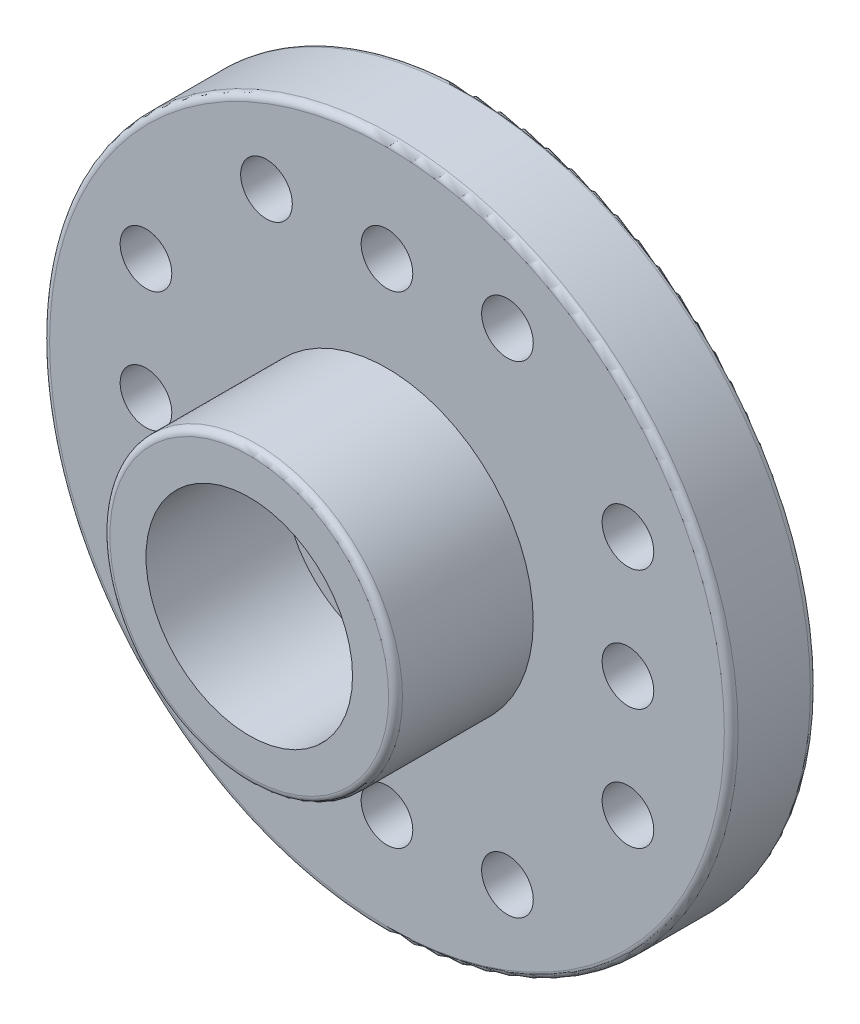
ISO-10303-21;
HEADER;
FILE_DESCRIPTION(('STEP AP214'),'2;1');
FILE_NAME('part.step','',(''),(''),'','','');
FILE_SCHEMA(('AUTOMOTIVE_DESIGN { 1 0 10303 214 1 1 1 1 }'));
ENDSEC;
DATA;
#1=APPLICATION_CONTEXT('core data for automotive mechanical design processes');
#2=APPLICATION_PROTOCOL_DEFINITION('international standard','automotive_design',2000,#1);
#3=PRODUCT_CONTEXT('',#1,'mechanical');
#4=PRODUCT('Part','Part','',(#3));
#5=PRODUCT_RELATED_PRODUCT_CATEGORY('part','',(#4));
#6=PRODUCT_DEFINITION_FORMATION('','',#4);
#7=PRODUCT_DEFINITION_CONTEXT('part definition',#1,'design');
#8=PRODUCT_DEFINITION('design','',#6,#7);
#9=PRODUCT_DEFINITION_SHAPE('','',#8);
#10=(LENGTH_UNIT() NAMED_UNIT(*) SI_UNIT(.MILLI.,.METRE.));
#11=(NAMED_UNIT(*) PLANE_ANGLE_UNIT() SI_UNIT($,.RADIAN.));
#12=(NAMED_UNIT(*) SI_UNIT($,.STERADIAN.) SOLID_ANGLE_UNIT());
#13=UNCERTAINTY_MEASURE_WITH_UNIT(LENGTH_MEASURE(1.E-05),#10,'distance_accuracy_value','');
#14=(GEOMETRIC_REPRESENTATION_CONTEXT(3) GLOBAL_UNCERTAINTY_ASSIGNED_CONTEXT((#13)) GLOBAL_UNIT_ASSIGNED_CONTEXT((#10,
#11,#12)) REPRESENTATION_CONTEXT('',''));
#15=CARTESIAN_POINT('',(0.,0.,0.));
#16=DIRECTION('',(0.,0.,1.));
#17=DIRECTION('',(1.,0.,0.));
#18=AXIS2_PLACEMENT_3D('',#15,#16,#17);
#19=CARTESIAN_POINT('',(0.,0.,0.8));
#20=DIRECTION('',(0.,0.,-1.));
#21=DIRECTION('',(-1.,0.,0.));
#22=AXIS2_PLACEMENT_3D('',#19,#20,#21);
#23=PLANE('',#22);
#24=CARTESIAN_POINT('',(0.,0.,0.8));
#25=DIRECTION('',(0.,0.,-1.));
#26=DIRECTION('',(-1.,0.,0.));
#27=AXIS2_PLACEMENT_3D('',#24,#25,#26);
#28=CIRCLE('',#27,4.5);
#29=CARTESIAN_POINT('',(-4.5,0.,0.8));
#30=VERTEX_POINT('',#29);
#31=EDGE_CURVE('E71',#30,#30,#28,.T.);
#32=ORIENTED_EDGE('',*,*,#31,.T.);
#33=EDGE_LOOP('',(#32));
#34=FACE_BOUND('',#33,.T.);
#35=CARTESIAN_POINT('',(-0.162730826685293,0.,0.8));
#36=DIRECTION('',(0.,0.,-1.));
#37=DIRECTION('',(-1.,0.,0.));
#38=AXIS2_PLACEMENT_3D('',#35,#36,#37);
#39=CIRCLE('',#38,3.7);
#40=CARTESIAN_POINT('',(-3.86273082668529,0.,0.8));
#41=VERTEX_POINT('',#40);
#42=EDGE_CURVE('E157',#41,#41,#39,.T.);
#43=ORIENTED_EDGE('',*,*,#42,.F.);
#44=EDGE_LOOP('',(#43));
#45=FACE_BOUND('',#44,.T.);
#46=ADVANCED_FACE('F31',(#34,#45),#23,.T.);
#47=CARTESIAN_POINT('',(0.,0.,2.5));
#48=DIRECTION('',(0.,0.,-1.));
#49=DIRECTION('',(-1.,0.,0.));
#50=AXIS2_PLACEMENT_3D('',#47,#48,#49);
#51=CYLINDRICAL_SURFACE('',#50,1.5);
#52=CARTESIAN_POINT('',(0.,0.,2.5));
#53=DIRECTION('',(0.,0.,1.));
#54=DIRECTION('',(1.,0.,0.));
#55=AXIS2_PLACEMENT_3D('',#52,#53,#54);
#56=CIRCLE('',#55,1.5);
#57=CARTESIAN_POINT('',(1.5,0.,2.5));
#58=VERTEX_POINT('',#57);
#59=EDGE_CURVE('E144',#58,#58,#56,.T.);
#60=ORIENTED_EDGE('',*,*,#59,.T.);
#61=EDGE_LOOP('',(#60));
#62=FACE_BOUND('',#61,.T.);
#63=CARTESIAN_POINT('',(0.,0.,0.8));
#64=DIRECTION('',(0.,0.,-1.));
#65=DIRECTION('',(-1.,0.,0.));
#66=AXIS2_PLACEMENT_3D('',#63,#64,#65);
#67=CIRCLE('',#66,1.5);
#68=CARTESIAN_POINT('',(-1.5,0.,0.8));
#69=VERTEX_POINT('',#68);
#70=EDGE_CURVE('E67',#69,#69,#67,.T.);
#71=ORIENTED_EDGE('',*,*,#70,.T.);
#72=EDGE_LOOP('',(#71));
#73=FACE_BOUND('',#72,.T.);
#74=ADVANCED_FACE('F186',(#62,#73),#51,.F.);
#75=CARTESIAN_POINT('',(0.,0.,2.5));
#76=DIRECTION('',(0.,0.,1.));
#77=DIRECTION('',(1.,0.,0.));
#78=AXIS2_PLACEMENT_3D('',#75,#76,#77);
#79=PLANE('',#78);
#80=CARTESIAN_POINT('',(0.,0.,2.5));
#81=DIRECTION('',(0.,0.,1.));
#82=DIRECTION('',(1.,0.,0.));
#83=AXIS2_PLACEMENT_3D('',#80,#81,#82);
#84=CIRCLE('',#83,9.79999999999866);
#85=CARTESIAN_POINT('',(9.79999999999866,0.,2.5));
#86=VERTEX_POINT('',#85);
#87=EDGE_CURVE('E10',#86,#86,#84,.T.);
#88=ORIENTED_EDGE('',*,*,#87,.T.);
#89=EDGE_LOOP('',(#88));
#90=FACE_BOUND('',#89,.T.);
#91=CARTESIAN_POINT('',(-7.,3.5,2.5));
#92=DIRECTION('',(0.,0.,1.));
#93=DIRECTION('',(1.,0.,0.));
#94=AXIS2_PLACEMENT_3D('',#91,#92,#93);
#95=CIRCLE('',#94,0.749999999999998);
#96=CARTESIAN_POINT('',(-6.25,3.5,2.5));
#97=VERTEX_POINT('',#96);
#98=EDGE_CURVE('E138',#97,#97,#95,.T.);
#99=ORIENTED_EDGE('',*,*,#98,.F.);
#100=EDGE_LOOP('',(#99));
#101=FACE_BOUND('',#100,.T.);
#102=CARTESIAN_POINT('',(-3.49999999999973,-6.99999999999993,2.5));
#103=DIRECTION('',(0.,0.,1.));
#104=DIRECTION('',(1.,0.,0.));
#105=AXIS2_PLACEMENT_3D('',#102,#103,#104);
#106=CIRCLE('',#105,0.749999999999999);
#107=CARTESIAN_POINT('',(-2.74999999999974,-6.99999999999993,2.5));
#108=VERTEX_POINT('',#107);
#109=EDGE_CURVE('E126',#108,#108,#106,.T.);
#110=ORIENTED_EDGE('',*,*,#109,.F.);
#111=EDGE_LOOP('',(#110));
#112=FACE_BOUND('',#111,.T.);
#113=CARTESIAN_POINT('',(2.65831209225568E-13,-6.99999999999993,2.5));
#114=DIRECTION('',(0.,0.,1.));
#115=DIRECTION('',(1.,0.,0.));
#116=AXIS2_PLACEMENT_3D('',#113,#114,#115);
#117=CIRCLE('',#116,0.749999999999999);
#118=CARTESIAN_POINT('',(0.750000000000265,-6.99999999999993,2.5));
#119=VERTEX_POINT('',#118);
#120=EDGE_CURVE('E114',#119,#119,#117,.T.);
#121=ORIENTED_EDGE('',*,*,#120,.F.);
#122=EDGE_LOOP('',(#121));
#123=FACE_BOUND('',#122,.T.);
#124=CARTESIAN_POINT('',(7.0000000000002,3.50000000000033,2.5));
#125=DIRECTION('',(0.,0.,1.));
#126=DIRECTION('',(1.,0.,0.));
#127=AXIS2_PLACEMENT_3D('',#124,#125,#126);
#128=CIRCLE('',#127,0.749999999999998);
#129=CARTESIAN_POINT('',(7.7500000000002,3.50000000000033,2.5));
#130=VERTEX_POINT('',#129);
#131=EDGE_CURVE('E102',#130,#130,#128,.T.);
#132=ORIENTED_EDGE('',*,*,#131,.F.);
#133=EDGE_LOOP('',(#132));
#134=FACE_BOUND('',#133,.T.);
#135=CARTESIAN_POINT('',(3.49999999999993,7.00000000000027,2.5));
#136=DIRECTION('',(0.,0.,1.));
#137=DIRECTION('',(1.,0.,0.));
#138=AXIS2_PLACEMENT_3D('',#135,#136,#137);
#139=CIRCLE('',#138,0.749999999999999);
#140=CARTESIAN_POINT('',(4.24999999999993,7.00000000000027,2.5));
#141=VERTEX_POINT('',#140);
#142=EDGE_CURVE('E90',#141,#141,#139,.T.);
#143=ORIENTED_EDGE('',*,*,#142,.F.);
#144=EDGE_LOOP('',(#143));
#145=FACE_BOUND('',#144,.T.);
#146=CARTESIAN_POINT('',(0.,7.00000000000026,2.5));
#147=DIRECTION('',(0.,0.,1.));
#148=DIRECTION('',(1.,0.,0.));
#149=AXIS2_PLACEMENT_3D('',#146,#147,#148);
#150=CIRCLE('',#149,0.749999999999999);
#151=CARTESIAN_POINT('',(0.74999999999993,7.00000000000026,2.5));
#152=VERTEX_POINT('',#151);
#153=EDGE_CURVE('E78',#152,#152,#150,.T.);
#154=ORIENTED_EDGE('',*,*,#153,.F.);
#155=EDGE_LOOP('',(#154));
#156=FACE_BOUND('',#155,.T.);
#157=CARTESIAN_POINT('',(-7.,0.,2.5));
#158=DIRECTION('',(0.,0.,1.));
#159=DIRECTION('',(1.,0.,0.));
#160=AXIS2_PLACEMENT_3D('',#157,#158,#159);
#161=CIRCLE('',#160,0.749999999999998);
#162=CARTESIAN_POINT('',(-6.25,0.,2.5));
#163=VERTEX_POINT('',#162);
#164=EDGE_CURVE('E74',#163,#163,#161,.T.);
#165=ORIENTED_EDGE('',*,*,#164,.F.);
#166=EDGE_LOOP('',(#165));
#167=FACE_BOUND('',#166,.T.);
#168=CARTESIAN_POINT('',(-3.50000000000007,7.00000000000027,2.5));
#169=DIRECTION('',(0.,0.,1.));
#170=DIRECTION('',(1.,0.,0.));
#171=AXIS2_PLACEMENT_3D('',#168,#169,#170);
#172=CIRCLE('',#171,0.749999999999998);
#173=CARTESIAN_POINT('',(-2.75000000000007,7.00000000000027,2.5));
#174=VERTEX_POINT('',#173);
#175=EDGE_CURVE('E84',#174,#174,#172,.T.);
#176=ORIENTED_EDGE('',*,*,#175,.F.);
#177=EDGE_LOOP('',(#176));
#178=FACE_BOUND('',#177,.T.);
#179=CARTESIAN_POINT('',(7.0000000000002,3.3392416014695E-13,2.5));
#180=DIRECTION('',(0.,0.,1.));
#181=DIRECTION('',(1.,0.,0.));
#182=AXIS2_PLACEMENT_3D('',#179,#180,#181);
#183=CIRCLE('',#182,0.749999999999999);
#184=CARTESIAN_POINT('',(7.7500000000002,3.3392416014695E-13,2.5));
#185=VERTEX_POINT('',#184);
#186=EDGE_CURVE('E96',#185,#185,#183,.T.);
#187=ORIENTED_EDGE('',*,*,#186,.F.);
#188=EDGE_LOOP('',(#187));
#189=FACE_BOUND('',#188,.T.);
#190=CARTESIAN_POINT('',(7.0000000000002,-3.49999999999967,2.5));
#191=DIRECTION('',(0.,0.,1.));
#192=DIRECTION('',(1.,0.,0.));
#193=AXIS2_PLACEMENT_3D('',#190,#191,#192);
#194=CIRCLE('',#193,0.749999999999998);
#195=CARTESIAN_POINT('',(7.7500000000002,-3.49999999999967,2.5));
#196=VERTEX_POINT('',#195);
#197=EDGE_CURVE('E108',#196,#196,#194,.T.);
#198=ORIENTED_EDGE('',*,*,#197,.F.);
#199=EDGE_LOOP('',(#198));
#200=FACE_BOUND('',#199,.T.);
#201=CARTESIAN_POINT('',(3.50000000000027,-6.99999999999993,2.5));
#202=DIRECTION('',(0.,0.,1.));
#203=DIRECTION('',(1.,0.,0.));
#204=AXIS2_PLACEMENT_3D('',#201,#202,#203);
#205=CIRCLE('',#204,0.749999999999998);
#206=CARTESIAN_POINT('',(4.25000000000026,-6.99999999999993,2.5));
#207=VERTEX_POINT('',#206);
#208=EDGE_CURVE('E120',#207,#207,#205,.T.);
#209=ORIENTED_EDGE('',*,*,#208,.F.);
#210=EDGE_LOOP('',(#209));
#211=FACE_BOUND('',#210,.T.);
#212=CARTESIAN_POINT('',(-7.,-3.5,2.5));
#213=DIRECTION('',(0.,0.,1.));
#214=DIRECTION('',(1.,0.,0.));
#215=AXIS2_PLACEMENT_3D('',#212,#213,#214);
#216=CIRCLE('',#215,0.749999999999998);
#217=CARTESIAN_POINT('',(-6.25,-3.5,2.5));
#218=VERTEX_POINT('',#217);
#219=EDGE_CURVE('E132',#218,#218,#216,.T.);
#220=ORIENTED_EDGE('',*,*,#219,.F.);
#221=EDGE_LOOP('',(#220));
#222=FACE_BOUND('',#221,.T.);
#223=CARTESIAN_POINT('',(0.,0.,2.5));
#224=DIRECTION('',(0.,0.,1.));
#225=DIRECTION('',(1.,0.,0.));
#226=AXIS2_PLACEMENT_3D('',#223,#224,#225);
#227=CIRCLE('',#226,4.25);
#228=CARTESIAN_POINT('',(4.25,0.,2.5));
#229=VERTEX_POINT('',#228);
#230=EDGE_CURVE('E149',#229,#229,#227,.T.);
#231=ORIENTED_EDGE('',*,*,#230,.F.);
#232=EDGE_LOOP('',(#231));
#233=FACE_BOUND('',#232,.T.);
#234=ADVANCED_FACE('F191',(#90,#101,#112,#123,#134,#145,#156,#167,#178,#189,#200,#211,#222,
#233),#79,.T.);
#235=CARTESIAN_POINT('',(0.,0.,2.5));
#236=DIRECTION('',(0.,0.,1.));
#237=DIRECTION('',(1.,0.,0.));
#238=AXIS2_PLACEMENT_3D('',#235,#236,#237);
#239=CIRCLE('',#238,3.);
#240=CARTESIAN_POINT('',(3.,0.,2.5));
#241=VERTEX_POINT('',#240);
#242=EDGE_CURVE('E66',#241,#241,#239,.F.);
#243=ORIENTED_EDGE('',*,*,#242,.F.);
#244=EDGE_LOOP('',(#243));
#245=FACE_BOUND('',#244,.T.);
#246=ORIENTED_EDGE('',*,*,#59,.F.);
#247=EDGE_LOOP('',(#246));
#248=FACE_BOUND('',#247,.T.);
#249=ADVANCED_FACE('F260',(#245,#248),#79,.T.);
#250=CARTESIAN_POINT('',(0.,0.,0.));
#251=DIRECTION('',(0.,0.,1.));
#252=DIRECTION('',(1.,0.,0.));
#253=AXIS2_PLACEMENT_3D('',#250,#251,#252);
#254=PLANE('',#253);
#255=CARTESIAN_POINT('',(0.,0.,0.));
#256=DIRECTION('',(0.,0.,1.));
#257=DIRECTION('',(1.,0.,0.));
#258=AXIS2_PLACEMENT_3D('',#255,#256,#257);
#259=CIRCLE('',#258,4.7);
#260=CARTESIAN_POINT('',(4.7,0.,0.));
#261=VERTEX_POINT('',#260);
#262=EDGE_CURVE('E54',#261,#261,#259,.T.);
#263=ORIENTED_EDGE('',*,*,#262,.T.);
#264=EDGE_LOOP('',(#263));
#265=FACE_BOUND('',#264,.T.);
#266=CARTESIAN_POINT('',(0.,0.,0.));
#267=DIRECTION('',(0.,0.,1.));
#268=DIRECTION('',(1.,0.,0.));
#269=AXIS2_PLACEMENT_3D('',#266,#267,#268);
#270=CIRCLE('',#269,9.79999999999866);
#271=CARTESIAN_POINT('',(9.79999999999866,0.,0.));
#272=VERTEX_POINT('',#271);
#273=EDGE_CURVE('E57',#272,#272,#270,.F.);
#274=ORIENTED_EDGE('',*,*,#273,.T.);
#275=EDGE_LOOP('',(#274));
#276=FACE_BOUND('',#275,.T.);
#277=CARTESIAN_POINT('',(-7.,3.5,0.));
#278=DIRECTION('',(0.,0.,1.));
#279=DIRECTION('',(1.,0.,0.));
#280=AXIS2_PLACEMENT_3D('',#277,#278,#279);
#281=CIRCLE('',#280,0.749999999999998);
#282=CARTESIAN_POINT('',(-6.25,3.5,0.));
#283=VERTEX_POINT('',#282);
#284=EDGE_CURVE('E141',#283,#283,#281,.T.);
#285=ORIENTED_EDGE('',*,*,#284,.T.);
#286=EDGE_LOOP('',(#285));
#287=FACE_BOUND('',#286,.T.);
#288=CARTESIAN_POINT('',(-3.49999999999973,-6.99999999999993,0.));
#289=DIRECTION('',(0.,0.,1.));
#290=DIRECTION('',(1.,0.,0.));
#291=AXIS2_PLACEMENT_3D('',#288,#289,#290);
#292=CIRCLE('',#291,0.749999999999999);
#293=CARTESIAN_POINT('',(-2.74999999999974,-6.99999999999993,0.));
#294=VERTEX_POINT('',#293);
#295=EDGE_CURVE('E129',#294,#294,#292,.T.);
#296=ORIENTED_EDGE('',*,*,#295,.T.);
#297=EDGE_LOOP('',(#296));
#298=FACE_BOUND('',#297,.T.);
#299=CARTESIAN_POINT('',(2.65831209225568E-13,-6.99999999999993,0.));
#300=DIRECTION('',(0.,0.,1.));
#301=DIRECTION('',(1.,0.,0.));
#302=AXIS2_PLACEMENT_3D('',#299,#300,#301);
#303=CIRCLE('',#302,0.749999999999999);
#304=CARTESIAN_POINT('',(0.750000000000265,-6.99999999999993,0.));
#305=VERTEX_POINT('',#304);
#306=EDGE_CURVE('E117',#305,#305,#303,.T.);
#307=ORIENTED_EDGE('',*,*,#306,.T.);
#308=EDGE_LOOP('',(#307));
#309=FACE_BOUND('',#308,.T.);
#310=CARTESIAN_POINT('',(7.0000000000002,3.50000000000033,0.));
#311=DIRECTION('',(0.,0.,1.));
#312=DIRECTION('',(1.,0.,0.));
#313=AXIS2_PLACEMENT_3D('',#310,#311,#312);
#314=CIRCLE('',#313,0.749999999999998);
#315=CARTESIAN_POINT('',(7.7500000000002,3.50000000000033,0.));
#316=VERTEX_POINT('',#315);
#317=EDGE_CURVE('E105',#316,#316,#314,.T.);
#318=ORIENTED_EDGE('',*,*,#317,.T.);
#319=EDGE_LOOP('',(#318));
#320=FACE_BOUND('',#319,.T.);
#321=CARTESIAN_POINT('',(3.49999999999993,7.00000000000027,0.));
#322=DIRECTION('',(0.,0.,1.));
#323=DIRECTION('',(1.,0.,0.));
#324=AXIS2_PLACEMENT_3D('',#321,#322,#323);
#325=CIRCLE('',#324,0.749999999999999);
#326=CARTESIAN_POINT('',(4.24999999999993,7.00000000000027,0.));
#327=VERTEX_POINT('',#326);
#328=EDGE_CURVE('E93',#327,#327,#325,.T.);
#329=ORIENTED_EDGE('',*,*,#328,.T.);
#330=EDGE_LOOP('',(#329));
#331=FACE_BOUND('',#330,.T.);
#332=CARTESIAN_POINT('',(0.,7.00000000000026,0.));
#333=DIRECTION('',(0.,0.,1.));
#334=DIRECTION('',(1.,0.,0.));
#335=AXIS2_PLACEMENT_3D('',#332,#333,#334);
#336=CIRCLE('',#335,0.749999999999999);
#337=CARTESIAN_POINT('',(0.74999999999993,7.00000000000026,0.));
#338=VERTEX_POINT('',#337);
#339=EDGE_CURVE('E81',#338,#338,#336,.T.);
#340=ORIENTED_EDGE('',*,*,#339,.T.);
#341=EDGE_LOOP('',(#340));
#342=FACE_BOUND('',#341,.T.);
#343=CARTESIAN_POINT('',(-7.,0.,0.));
#344=DIRECTION('',(0.,0.,1.));
#345=DIRECTION('',(1.,0.,0.));
#346=AXIS2_PLACEMENT_3D('',#343,#344,#345);
#347=CIRCLE('',#346,0.749999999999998);
#348=CARTESIAN_POINT('',(-6.25,0.,0.));
#349=VERTEX_POINT('',#348);
#350=EDGE_CURVE('E75',#349,#349,#347,.T.);
#351=ORIENTED_EDGE('',*,*,#350,.T.);
#352=EDGE_LOOP('',(#351));
#353=FACE_BOUND('',#352,.T.);
#354=CARTESIAN_POINT('',(-3.50000000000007,7.00000000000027,0.));
#355=DIRECTION('',(0.,0.,1.));
#356=DIRECTION('',(1.,0.,0.));
#357=AXIS2_PLACEMENT_3D('',#354,#355,#356);
#358=CIRCLE('',#357,0.749999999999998);
#359=CARTESIAN_POINT('',(-2.75000000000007,7.00000000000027,0.));
#360=VERTEX_POINT('',#359);
#361=EDGE_CURVE('E87',#360,#360,#358,.T.);
#362=ORIENTED_EDGE('',*,*,#361,.T.);
#363=EDGE_LOOP('',(#362));
#364=FACE_BOUND('',#363,.T.);
#365=CARTESIAN_POINT('',(7.0000000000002,3.3392416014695E-13,0.));
#366=DIRECTION('',(0.,0.,1.));
#367=DIRECTION('',(1.,0.,0.));
#368=AXIS2_PLACEMENT_3D('',#365,#366,#367);
#369=CIRCLE('',#368,0.749999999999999);
#370=CARTESIAN_POINT('',(7.7500000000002,3.3392416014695E-13,0.));
#371=VERTEX_POINT('',#370);
#372=EDGE_CURVE('E99',#371,#371,#369,.T.);
#373=ORIENTED_EDGE('',*,*,#372,.T.);
#374=EDGE_LOOP('',(#373));
#375=FACE_BOUND('',#374,.T.);
#376=CARTESIAN_POINT('',(7.0000000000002,-3.49999999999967,0.));
#377=DIRECTION('',(0.,0.,1.));
#378=DIRECTION('',(1.,0.,0.));
#379=AXIS2_PLACEMENT_3D('',#376,#377,#378);
#380=CIRCLE('',#379,0.749999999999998);
#381=CARTESIAN_POINT('',(7.7500000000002,-3.49999999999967,0.));
#382=VERTEX_POINT('',#381);
#383=EDGE_CURVE('E111',#382,#382,#380,.T.);
#384=ORIENTED_EDGE('',*,*,#383,.T.);
#385=EDGE_LOOP('',(#384));
#386=FACE_BOUND('',#385,.T.);
#387=CARTESIAN_POINT('',(3.50000000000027,-6.99999999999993,0.));
#388=DIRECTION('',(0.,0.,1.));
#389=DIRECTION('',(1.,0.,0.));
#390=AXIS2_PLACEMENT_3D('',#387,#388,#389);
#391=CIRCLE('',#390,0.749999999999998);
#392=CARTESIAN_POINT('',(4.25000000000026,-6.99999999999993,0.));
#393=VERTEX_POINT('',#392);
#394=EDGE_CURVE('E123',#393,#393,#391,.T.);
#395=ORIENTED_EDGE('',*,*,#394,.T.);
#396=EDGE_LOOP('',(#395));
#397=FACE_BOUND('',#396,.T.);
#398=CARTESIAN_POINT('',(-7.,-3.5,0.));
#399=DIRECTION('',(0.,0.,1.));
#400=DIRECTION('',(1.,0.,0.));
#401=AXIS2_PLACEMENT_3D('',#398,#399,#400);
#402=CIRCLE('',#401,0.749999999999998);
#403=CARTESIAN_POINT('',(-6.25,-3.5,0.));
#404=VERTEX_POINT('',#403);
#405=EDGE_CURVE('E135',#404,#404,#402,.T.);
#406=ORIENTED_EDGE('',*,*,#405,.T.);
#407=EDGE_LOOP('',(#406));
#408=FACE_BOUND('',#407,.T.);
#409=ADVANCED_FACE('F263',(#265,#276,#287,#298,#309,#320,#331,#342,#353,#364,#375,#386,#397,
#408),#254,.F.);
#410=CARTESIAN_POINT('',(0.,0.,2.5));
#411=DIRECTION('',(0.,0.,-1.));
#412=DIRECTION('',(-1.,0.,0.));
#413=AXIS2_PLACEMENT_3D('',#410,#411,#412);
#414=CYLINDRICAL_SURFACE('',#413,9.99999999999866);
#415=CARTESIAN_POINT('',(0.,0.,0.2));
#416=DIRECTION('',(0.,0.,1.));
#417=DIRECTION('',(1.,0.,0.));
#418=AXIS2_PLACEMENT_3D('',#415,#416,#417);
#419=CIRCLE('',#418,9.99999999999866);
#420=CARTESIAN_POINT('',(9.99999999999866,0.,0.2));
#421=VERTEX_POINT('',#420);
#422=EDGE_CURVE('E38',#421,#421,#419,.T.);
#423=ORIENTED_EDGE('',*,*,#422,.T.);
#424=EDGE_LOOP('',(#423));
#425=FACE_BOUND('',#424,.T.);
#426=CARTESIAN_POINT('',(0.,0.,2.3));
#427=DIRECTION('',(0.,0.,1.));
#428=DIRECTION('',(1.,0.,0.));
#429=AXIS2_PLACEMENT_3D('',#426,#427,#428);
#430=CIRCLE('',#429,9.99999999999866);
#431=CARTESIAN_POINT('',(9.99999999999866,0.,2.3));
#432=VERTEX_POINT('',#431);
#433=EDGE_CURVE('E42',#432,#432,#430,.F.);
#434=ORIENTED_EDGE('',*,*,#433,.T.);
#435=EDGE_LOOP('',(#434));
#436=FACE_BOUND('',#435,.T.);
#437=ADVANCED_FACE('F258',(#425,#436),#414,.T.);
#438=CARTESIAN_POINT('',(-7.,0.,2.5));
#439=DIRECTION('',(0.,0.,-1.));
#440=DIRECTION('',(-1.,0.,0.));
#441=AXIS2_PLACEMENT_3D('',#438,#439,#440);
#442=CYLINDRICAL_SURFACE('',#441,0.749999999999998);
#443=ORIENTED_EDGE('',*,*,#164,.T.);
#444=EDGE_LOOP('',(#443));
#445=FACE_BOUND('',#444,.T.);
#446=ORIENTED_EDGE('',*,*,#350,.F.);
#447=EDGE_LOOP('',(#446));
#448=FACE_BOUND('',#447,.T.);
#449=ADVANCED_FACE('F254',(#445,#448),#442,.F.);
#450=CARTESIAN_POINT('',(0.,7.00000000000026,2.5));
#451=DIRECTION('',(0.,0.,-1.));
#452=DIRECTION('',(-1.,0.,0.));
#453=AXIS2_PLACEMENT_3D('',#450,#451,#452);
#454=CYLINDRICAL_SURFACE('',#453,0.749999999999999);
#455=ORIENTED_EDGE('',*,*,#153,.T.);
#456=EDGE_LOOP('',(#455));
#457=FACE_BOUND('',#456,.T.);
#458=ORIENTED_EDGE('',*,*,#339,.F.);
#459=EDGE_LOOP('',(#458));
#460=FACE_BOUND('',#459,.T.);
#461=ADVANCED_FACE('F250',(#457,#460),#454,.F.);
#462=CARTESIAN_POINT('',(-3.50000000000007,7.00000000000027,2.5));
#463=DIRECTION('',(0.,0.,-1.));
#464=DIRECTION('',(-1.,0.,0.));
#465=AXIS2_PLACEMENT_3D('',#462,#463,#464);
#466=CYLINDRICAL_SURFACE('',#465,0.749999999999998);
#467=ORIENTED_EDGE('',*,*,#175,.T.);
#468=EDGE_LOOP('',(#467));
#469=FACE_BOUND('',#468,.T.);
#470=ORIENTED_EDGE('',*,*,#361,.F.);
#471=EDGE_LOOP('',(#470));
#472=FACE_BOUND('',#471,.T.);
#473=ADVANCED_FACE('F246',(#469,#472),#466,.F.);
#474=CARTESIAN_POINT('',(3.49999999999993,7.00000000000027,2.5));
#475=DIRECTION('',(0.,0.,-1.));
#476=DIRECTION('',(-1.,0.,0.));
#477=AXIS2_PLACEMENT_3D('',#474,#475,#476);
#478=CYLINDRICAL_SURFACE('',#477,0.749999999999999);
#479=ORIENTED_EDGE('',*,*,#142,.T.);
#480=EDGE_LOOP('',(#479));
#481=FACE_BOUND('',#480,.T.);
#482=ORIENTED_EDGE('',*,*,#328,.F.);
#483=EDGE_LOOP('',(#482));
#484=FACE_BOUND('',#483,.T.);
#485=ADVANCED_FACE('F242',(#481,#484),#478,.F.);
#486=CARTESIAN_POINT('',(7.0000000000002,3.3392416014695E-13,2.5));
#487=DIRECTION('',(0.,0.,-1.));
#488=DIRECTION('',(-1.,0.,0.));
#489=AXIS2_PLACEMENT_3D('',#486,#487,#488);
#490=CYLINDRICAL_SURFACE('',#489,0.749999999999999);
#491=ORIENTED_EDGE('',*,*,#186,.T.);
#492=EDGE_LOOP('',(#491));
#493=FACE_BOUND('',#492,.T.);
#494=ORIENTED_EDGE('',*,*,#372,.F.);
#495=EDGE_LOOP('',(#494));
#496=FACE_BOUND('',#495,.T.);
#497=ADVANCED_FACE('F238',(#493,#496),#490,.F.);
#498=CARTESIAN_POINT('',(7.0000000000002,3.50000000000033,2.5));
#499=DIRECTION('',(0.,0.,-1.));
#500=DIRECTION('',(-1.,0.,0.));
#501=AXIS2_PLACEMENT_3D('',#498,#499,#500);
#502=CYLINDRICAL_SURFACE('',#501,0.749999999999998);
#503=ORIENTED_EDGE('',*,*,#131,.T.);
#504=EDGE_LOOP('',(#503));
#505=FACE_BOUND('',#504,.T.);
#506=ORIENTED_EDGE('',*,*,#317,.F.);
#507=EDGE_LOOP('',(#506));
#508=FACE_BOUND('',#507,.T.);
#509=ADVANCED_FACE('F234',(#505,#508),#502,.F.);
#510=CARTESIAN_POINT('',(7.0000000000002,-3.49999999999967,2.5));
#511=DIRECTION('',(0.,0.,-1.));
#512=DIRECTION('',(-1.,0.,0.));
#513=AXIS2_PLACEMENT_3D('',#510,#511,#512);
#514=CYLINDRICAL_SURFACE('',#513,0.749999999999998);
#515=ORIENTED_EDGE('',*,*,#197,.T.);
#516=EDGE_LOOP('',(#515));
#517=FACE_BOUND('',#516,.T.);
#518=ORIENTED_EDGE('',*,*,#383,.F.);
#519=EDGE_LOOP('',(#518));
#520=FACE_BOUND('',#519,.T.);
#521=ADVANCED_FACE('F230',(#517,#520),#514,.F.);
#522=CARTESIAN_POINT('',(2.65831209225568E-13,-6.99999999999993,2.5));
#523=DIRECTION('',(0.,0.,-1.));
#524=DIRECTION('',(-1.,0.,0.));
#525=AXIS2_PLACEMENT_3D('',#522,#523,#524);
#526=CYLINDRICAL_SURFACE('',#525,0.749999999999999);
#527=ORIENTED_EDGE('',*,*,#120,.T.);
#528=EDGE_LOOP('',(#527));
#529=FACE_BOUND('',#528,.T.);
#530=ORIENTED_EDGE('',*,*,#306,.F.);
#531=EDGE_LOOP('',(#530));
#532=FACE_BOUND('',#531,.T.);
#533=ADVANCED_FACE('F226',(#529,#532),#526,.F.);
#534=CARTESIAN_POINT('',(3.50000000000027,-6.99999999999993,2.5));
#535=DIRECTION('',(0.,0.,-1.));
#536=DIRECTION('',(-1.,0.,0.));
#537=AXIS2_PLACEMENT_3D('',#534,#535,#536);
#538=CYLINDRICAL_SURFACE('',#537,0.749999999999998);
#539=ORIENTED_EDGE('',*,*,#208,.T.);
#540=EDGE_LOOP('',(#539));
#541=FACE_BOUND('',#540,.T.);
#542=ORIENTED_EDGE('',*,*,#394,.F.);
#543=EDGE_LOOP('',(#542));
#544=FACE_BOUND('',#543,.T.);
#545=ADVANCED_FACE('F222',(#541,#544),#538,.F.);
#546=CARTESIAN_POINT('',(-3.49999999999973,-6.99999999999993,2.5));
#547=DIRECTION('',(0.,0.,-1.));
#548=DIRECTION('',(-1.,0.,0.));
#549=AXIS2_PLACEMENT_3D('',#546,#547,#548);
#550=CYLINDRICAL_SURFACE('',#549,0.749999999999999);
#551=ORIENTED_EDGE('',*,*,#109,.T.);
#552=EDGE_LOOP('',(#551));
#553=FACE_BOUND('',#552,.T.);
#554=ORIENTED_EDGE('',*,*,#295,.F.);
#555=EDGE_LOOP('',(#554));
#556=FACE_BOUND('',#555,.T.);
#557=ADVANCED_FACE('F218',(#553,#556),#550,.F.);
#558=CARTESIAN_POINT('',(-7.,-3.5,2.5));
#559=DIRECTION('',(0.,0.,-1.));
#560=DIRECTION('',(-1.,0.,0.));
#561=AXIS2_PLACEMENT_3D('',#558,#559,#560);
#562=CYLINDRICAL_SURFACE('',#561,0.749999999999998);
#563=ORIENTED_EDGE('',*,*,#219,.T.);
#564=EDGE_LOOP('',(#563));
#565=FACE_BOUND('',#564,.T.);
#566=ORIENTED_EDGE('',*,*,#405,.F.);
#567=EDGE_LOOP('',(#566));
#568=FACE_BOUND('',#567,.T.);
#569=ADVANCED_FACE('F214',(#565,#568),#562,.F.);
#570=CARTESIAN_POINT('',(-7.,3.5,2.5));
#571=DIRECTION('',(0.,0.,-1.));
#572=DIRECTION('',(-1.,0.,0.));
#573=AXIS2_PLACEMENT_3D('',#570,#571,#572);
#574=CYLINDRICAL_SURFACE('',#573,0.749999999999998);
#575=ORIENTED_EDGE('',*,*,#98,.T.);
#576=EDGE_LOOP('',(#575));
#577=FACE_BOUND('',#576,.T.);
#578=ORIENTED_EDGE('',*,*,#284,.F.);
#579=EDGE_LOOP('',(#578));
#580=FACE_BOUND('',#579,.T.);
#581=ADVANCED_FACE('F207',(#577,#580),#574,.F.);
#582=CARTESIAN_POINT('',(0.,0.,6.5));
#583=DIRECTION('',(0.,0.,1.));
#584=DIRECTION('',(1.,0.,0.));
#585=AXIS2_PLACEMENT_3D('',#582,#583,#584);
#586=PLANE('',#585);
#587=CARTESIAN_POINT('',(0.,0.,6.5));
#588=DIRECTION('',(0.,0.,1.));
#589=DIRECTION('',(1.,0.,0.));
#590=AXIS2_PLACEMENT_3D('',#587,#588,#589);
#591=CIRCLE('',#590,4.05);
#592=CARTESIAN_POINT('',(4.05,0.,6.5));
#593=VERTEX_POINT('',#592);
#594=EDGE_CURVE('E51',#593,#593,#591,.T.);
#595=ORIENTED_EDGE('',*,*,#594,.T.);
#596=EDGE_LOOP('',(#595));
#597=FACE_BOUND('',#596,.T.);
#598=CARTESIAN_POINT('',(0.,0.,6.5));
#599=DIRECTION('',(0.,0.,1.));
#600=DIRECTION('',(1.,0.,0.));
#601=AXIS2_PLACEMENT_3D('',#598,#599,#600);
#602=CIRCLE('',#601,3.);
#603=CARTESIAN_POINT('',(3.,0.,6.5));
#604=VERTEX_POINT('',#603);
#605=EDGE_CURVE('E70',#604,#604,#602,.T.);
#606=ORIENTED_EDGE('',*,*,#605,.F.);
#607=EDGE_LOOP('',(#606));
#608=FACE_BOUND('',#607,.T.);
#609=ADVANCED_FACE('F204',(#597,#608),#586,.T.);
#610=CARTESIAN_POINT('',(0.,0.,6.5));
#611=DIRECTION('',(0.,0.,-1.));
#612=DIRECTION('',(-1.,0.,0.));
#613=AXIS2_PLACEMENT_3D('',#610,#611,#612);
#614=CYLINDRICAL_SURFACE('',#613,4.25);
#615=CARTESIAN_POINT('',(0.,0.,6.3));
#616=DIRECTION('',(0.,0.,1.));
#617=DIRECTION('',(1.,0.,0.));
#618=AXIS2_PLACEMENT_3D('',#615,#616,#617);
#619=CIRCLE('',#618,4.25);
#620=CARTESIAN_POINT('',(4.25,0.,6.3));
#621=VERTEX_POINT('',#620);
#622=EDGE_CURVE('E46',#621,#621,#619,.F.);
#623=ORIENTED_EDGE('',*,*,#622,.T.);
#624=EDGE_LOOP('',(#623));
#625=FACE_BOUND('',#624,.T.);
#626=ORIENTED_EDGE('',*,*,#230,.T.);
#627=EDGE_LOOP('',(#626));
#628=FACE_BOUND('',#627,.T.);
#629=ADVANCED_FACE('F202',(#625,#628),#614,.T.);
#630=CARTESIAN_POINT('',(0.,0.,6.5));
#631=DIRECTION('',(0.,0.,-1.));
#632=DIRECTION('',(-1.,0.,0.));
#633=AXIS2_PLACEMENT_3D('',#630,#631,#632);
#634=CYLINDRICAL_SURFACE('',#633,3.);
#635=ORIENTED_EDGE('',*,*,#605,.T.);
#636=EDGE_LOOP('',(#635));
#637=FACE_BOUND('',#636,.T.);
#638=ORIENTED_EDGE('',*,*,#242,.T.);
#639=EDGE_LOOP('',(#638));
#640=FACE_BOUND('',#639,.T.);
#641=ADVANCED_FACE('F198',(#637,#640),#634,.F.);
#642=CARTESIAN_POINT('',(0.,0.,0.8));
#643=DIRECTION('',(0.,0.,-1.));
#644=DIRECTION('',(-1.,0.,0.));
#645=AXIS2_PLACEMENT_3D('',#642,#643,#644);
#646=CYLINDRICAL_SURFACE('',#645,4.5);
#647=CARTESIAN_POINT('',(0.,0.,0.2));
#648=DIRECTION('',(0.,0.,1.));
#649=DIRECTION('',(1.,0.,0.));
#650=AXIS2_PLACEMENT_3D('',#647,#648,#649);
#651=CIRCLE('',#650,4.5);
#652=CARTESIAN_POINT('',(4.5,0.,0.2));
#653=VERTEX_POINT('',#652);
#654=EDGE_CURVE('E60',#653,#653,#651,.F.);
#655=ORIENTED_EDGE('',*,*,#654,.T.);
#656=EDGE_LOOP('',(#655));
#657=FACE_BOUND('',#656,.T.);
#658=ORIENTED_EDGE('',*,*,#31,.F.);
#659=EDGE_LOOP('',(#658));
#660=FACE_BOUND('',#659,.T.);
#661=ADVANCED_FACE('F181',(#657,#660),#646,.F.);
#662=CARTESIAN_POINT('',(-0.162730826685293,0.,0.8));
#663=DIRECTION('',(0.,0.,-1.));
#664=DIRECTION('',(-1.,0.,0.));
#665=AXIS2_PLACEMENT_3D('',#662,#663,#664);
#666=CIRCLE('',#665,3.5);
#667=CARTESIAN_POINT('',(-3.66273082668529,0.,0.8));
#668=VERTEX_POINT('',#667);
#669=EDGE_CURVE('E63',#668,#668,#666,.F.);
#670=ORIENTED_EDGE('',*,*,#669,.F.);
#671=EDGE_LOOP('',(#670));
#672=FACE_BOUND('',#671,.T.);
#673=ORIENTED_EDGE('',*,*,#70,.F.);
#674=EDGE_LOOP('',(#673));
#675=FACE_BOUND('',#674,.T.);
#676=ADVANCED_FACE('F172',(#672,#675),#23,.T.);
#677=CARTESIAN_POINT('',(-0.162730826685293,0.,-0.2));
#678=DIRECTION('',(0.,0.,-1.));
#679=DIRECTION('',(-1.,0.,0.));
#680=AXIS2_PLACEMENT_3D('',#677,#678,#679);
#681=PLANE('',#680);
#682=CARTESIAN_POINT('',(-0.162730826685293,0.,-0.2));
#683=DIRECTION('',(0.,0.,-1.));
#684=DIRECTION('',(-1.,0.,0.));
#685=AXIS2_PLACEMENT_3D('',#682,#683,#684);
#686=CIRCLE('',#685,3.7);
#687=CARTESIAN_POINT('',(-3.86273082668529,0.,-0.2));
#688=VERTEX_POINT('',#687);
#689=EDGE_CURVE('E156',#688,#688,#686,.T.);
#690=ORIENTED_EDGE('',*,*,#689,.T.);
#691=EDGE_LOOP('',(#690));
#692=FACE_BOUND('',#691,.T.);
#693=CARTESIAN_POINT('',(-0.162730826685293,0.,-0.2));
#694=DIRECTION('',(0.,0.,-1.));
#695=DIRECTION('',(-1.,0.,0.));
#696=AXIS2_PLACEMENT_3D('',#693,#694,#695);
#697=CIRCLE('',#696,3.5);
#698=CARTESIAN_POINT('',(-3.66273082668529,0.,-0.2));
#699=VERTEX_POINT('',#698);
#700=EDGE_CURVE('E160',#699,#699,#697,.T.);
#701=ORIENTED_EDGE('',*,*,#700,.F.);
#702=EDGE_LOOP('',(#701));
#703=FACE_BOUND('',#702,.T.);
#704=ADVANCED_FACE('F169',(#692,#703),#681,.T.);
#705=CARTESIAN_POINT('',(-0.162730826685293,0.,-0.2));
#706=DIRECTION('',(0.,0.,1.));
#707=DIRECTION('',(1.,0.,0.));
#708=AXIS2_PLACEMENT_3D('',#705,#706,#707);
#709=CYLINDRICAL_SURFACE('',#708,3.7);
#710=ORIENTED_EDGE('',*,*,#689,.F.);
#711=EDGE_LOOP('',(#710));
#712=FACE_BOUND('',#711,.T.);
#713=ORIENTED_EDGE('',*,*,#42,.T.);
#714=EDGE_LOOP('',(#713));
#715=FACE_BOUND('',#714,.T.);
#716=ADVANCED_FACE('F171',(#712,#715),#709,.T.);
#717=CARTESIAN_POINT('',(-0.162730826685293,0.,-0.2));
#718=DIRECTION('',(0.,0.,1.));
#719=DIRECTION('',(1.,0.,0.));
#720=AXIS2_PLACEMENT_3D('',#717,#718,#719);
#721=CYLINDRICAL_SURFACE('',#720,3.5);
#722=ORIENTED_EDGE('',*,*,#700,.T.);
#723=EDGE_LOOP('',(#722));
#724=FACE_BOUND('',#723,.T.);
#725=ORIENTED_EDGE('',*,*,#669,.T.);
#726=EDGE_LOOP('',(#725));
#727=FACE_BOUND('',#726,.T.);
#728=ADVANCED_FACE('F166',(#724,#727),#721,.F.);
#729=CARTESIAN_POINT('',(0.,0.,0.2));
#730=DIRECTION('',(0.,0.,1.));
#731=DIRECTION('',(1.,0.,0.));
#732=AXIS2_PLACEMENT_3D('',#729,#730,#731);
#733=TOROIDAL_SURFACE('',#732,4.7,0.2);
#734=ORIENTED_EDGE('',*,*,#262,.F.);
#735=EDGE_LOOP('',(#734));
#736=FACE_BOUND('',#735,.T.);
#737=ORIENTED_EDGE('',*,*,#654,.F.);
#738=EDGE_LOOP('',(#737));
#739=FACE_BOUND('',#738,.T.);
#740=ADVANCED_FACE('F270',(#736,#739),#733,.T.);
#741=CARTESIAN_POINT('',(0.,0.,6.3));
#742=DIRECTION('',(0.,0.,1.));
#743=DIRECTION('',(1.,0.,0.));
#744=AXIS2_PLACEMENT_3D('',#741,#742,#743);
#745=TOROIDAL_SURFACE('',#744,4.05,0.2);
#746=ORIENTED_EDGE('',*,*,#622,.F.);
#747=EDGE_LOOP('',(#746));
#748=FACE_BOUND('',#747,.T.);
#749=ORIENTED_EDGE('',*,*,#594,.F.);
#750=EDGE_LOOP('',(#749));
#751=FACE_BOUND('',#750,.T.);
#752=ADVANCED_FACE('F273',(#748,#751),#745,.T.);
#753=CARTESIAN_POINT('',(0.,0.,0.2));
#754=DIRECTION('',(0.,0.,1.));
#755=DIRECTION('',(1.,0.,0.));
#756=AXIS2_PLACEMENT_3D('',#753,#754,#755);
#757=TOROIDAL_SURFACE('',#756,9.79999999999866,0.2);
#758=ORIENTED_EDGE('',*,*,#273,.F.);
#759=EDGE_LOOP('',(#758));
#760=FACE_BOUND('',#759,.T.);
#761=ORIENTED_EDGE('',*,*,#422,.F.);
#762=EDGE_LOOP('',(#761));
#763=FACE_BOUND('',#762,.T.);
#764=ADVANCED_FACE('F276',(#760,#763),#757,.T.);
#765=CARTESIAN_POINT('',(0.,0.,2.3));
#766=DIRECTION('',(0.,0.,1.));
#767=DIRECTION('',(1.,0.,0.));
#768=AXIS2_PLACEMENT_3D('',#765,#766,#767);
#769=TOROIDAL_SURFACE('',#768,9.79999999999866,0.2);
#770=ORIENTED_EDGE('',*,*,#433,.F.);
#771=EDGE_LOOP('',(#770));
#772=FACE_BOUND('',#771,.T.);
#773=ORIENTED_EDGE('',*,*,#87,.F.);
#774=EDGE_LOOP('',(#773));
#775=FACE_BOUND('',#774,.T.);
#776=ADVANCED_FACE('F33',(#772,#775),#769,.T.);
#777=CLOSED_SHELL('',(#46,#74,#234,#249,#409,#437,#449,#461,#473,#485,#497,#509,#521,#533,#545,
#557,#569,#581,#609,#629,#641,#661,#676,#704,#716,#728,#740,#752,#764,#776));
#778=MANIFOLD_SOLID_BREP('B2',#777);
#779=ADVANCED_BREP_SHAPE_REPRESENTATION('',(#18,#778),#14);
#780=SHAPE_DEFINITION_REPRESENTATION(#9,#779);
ENDSEC;
END-ISO-10303-21;
